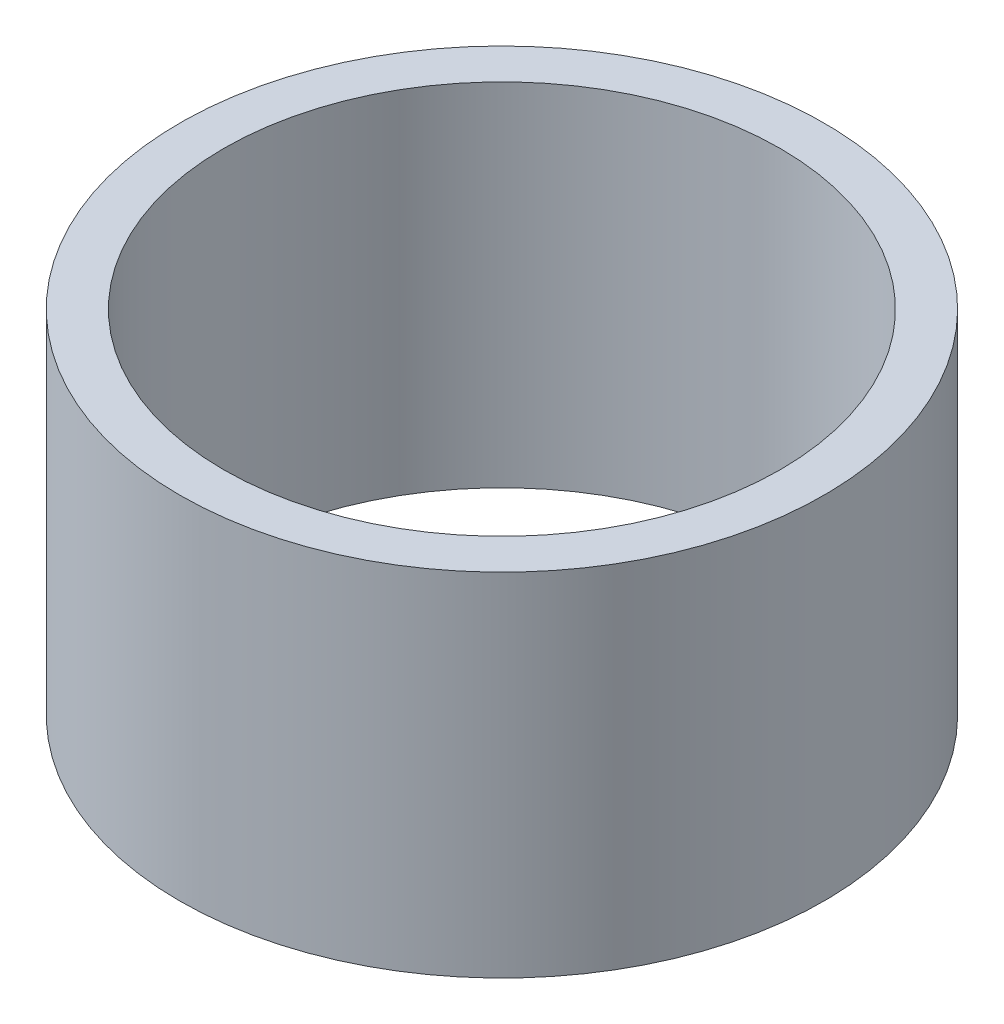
from build123d import *

# Parameters (mm, degrees)
SKETCH1_R      = 11
SKETCH1_R_2    = 9.5
EXTRUDE1_DEPTH = 12


with BuildPart() as part:
    # Sketch1 → Extrude1 (new body)
    with BuildSketch(Plane(origin=(0, 0, 0), x_dir=(1, 0, 0), z_dir=(0, 1, 0))):
        with Locations(Location((0, 0, 0), (0, 0, 270))):
            Circle(SKETCH1_R)
        with Locations(Location((0, 0, 0), (0, 0, 270))):
            Circle(SKETCH1_R_2, mode=Mode.SUBTRACT)
    extrude(amount=EXTRUDE1_DEPTH)


solid = part.part
